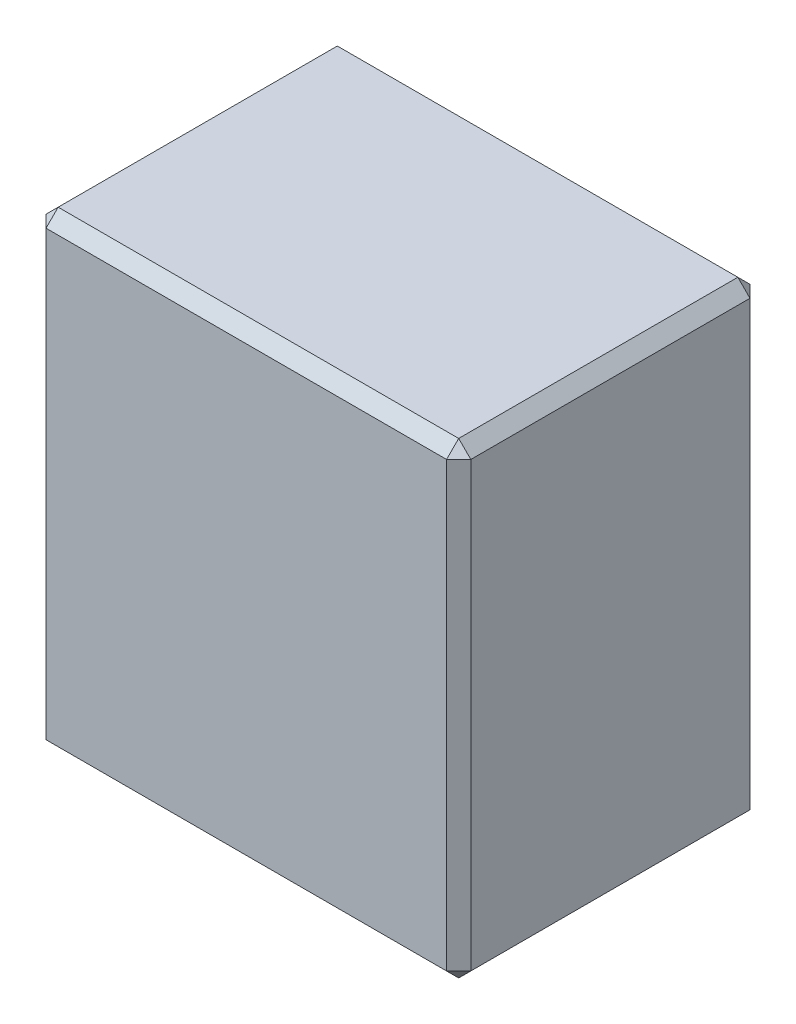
ISO-10303-21;
HEADER;
FILE_DESCRIPTION(('STEP AP214'),'2;1');
FILE_NAME('part.step','',(''),(''),'','','');
FILE_SCHEMA(('AUTOMOTIVE_DESIGN { 1 0 10303 214 1 1 1 1 }'));
ENDSEC;
DATA;
#1=APPLICATION_CONTEXT('core data for automotive mechanical design processes');
#2=APPLICATION_PROTOCOL_DEFINITION('international standard','automotive_design',2000,#1);
#3=PRODUCT_CONTEXT('',#1,'mechanical');
#4=PRODUCT('Part','Part','',(#3));
#5=PRODUCT_RELATED_PRODUCT_CATEGORY('part','',(#4));
#6=PRODUCT_DEFINITION_FORMATION('','',#4);
#7=PRODUCT_DEFINITION_CONTEXT('part definition',#1,'design');
#8=PRODUCT_DEFINITION('design','',#6,#7);
#9=PRODUCT_DEFINITION_SHAPE('','',#8);
#10=(LENGTH_UNIT() NAMED_UNIT(*) SI_UNIT(.MILLI.,.METRE.));
#11=(NAMED_UNIT(*) PLANE_ANGLE_UNIT() SI_UNIT($,.RADIAN.));
#12=(NAMED_UNIT(*) SI_UNIT($,.STERADIAN.) SOLID_ANGLE_UNIT());
#13=UNCERTAINTY_MEASURE_WITH_UNIT(LENGTH_MEASURE(1.E-05),#10,'distance_accuracy_value','');
#14=(GEOMETRIC_REPRESENTATION_CONTEXT(3) GLOBAL_UNCERTAINTY_ASSIGNED_CONTEXT((#13)) GLOBAL_UNIT_ASSIGNED_CONTEXT((#10,
#11,#12)) REPRESENTATION_CONTEXT('',''));
#15=CARTESIAN_POINT('',(0.,0.,0.));
#16=DIRECTION('',(0.,0.,1.));
#17=DIRECTION('',(1.,0.,0.));
#18=AXIS2_PLACEMENT_3D('',#15,#16,#17);
#19=CARTESIAN_POINT('',(0.,3.85,0.));
#20=DIRECTION('',(1.,0.,0.));
#21=DIRECTION('',(0.,0.,-1.));
#22=AXIS2_PLACEMENT_3D('',#19,#20,#21);
#23=PLANE('',#22);
#24=DIRECTION('',(0.,1.,0.));
#25=VECTOR('',#24,1.);
#26=CARTESIAN_POINT('',(0.,3.85,-0.100000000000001));
#27=LINE('',#26,#25);
#28=CARTESIAN_POINT('',(0.,0.1,-0.100000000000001));
#29=VERTEX_POINT('',#28);
#30=CARTESIAN_POINT('',(0.,3.75,-0.100000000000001));
#31=VERTEX_POINT('',#30);
#32=EDGE_CURVE('E179',#29,#31,#27,.T.);
#33=ORIENTED_EDGE('',*,*,#32,.T.);
#34=DIRECTION('',(0.,0.,-1.));
#35=VECTOR('',#34,1.);
#36=CARTESIAN_POINT('',(0.,3.75,0.));
#37=LINE('',#36,#35);
#38=CARTESIAN_POINT('',(0.,3.75,-2.4));
#39=VERTEX_POINT('',#38);
#40=EDGE_CURVE('E184',#31,#39,#37,.T.);
#41=ORIENTED_EDGE('',*,*,#40,.T.);
#42=DIRECTION('',(0.,-1.,0.));
#43=VECTOR('',#42,1.);
#44=CARTESIAN_POINT('',(0.,3.85,-2.4));
#45=LINE('',#44,#43);
#46=CARTESIAN_POINT('',(0.,0.1,-2.4));
#47=VERTEX_POINT('',#46);
#48=EDGE_CURVE('E181',#39,#47,#45,.T.);
#49=ORIENTED_EDGE('',*,*,#48,.T.);
#50=DIRECTION('',(0.,0.,1.));
#51=VECTOR('',#50,1.);
#52=CARTESIAN_POINT('',(0.,0.1,0.));
#53=LINE('',#52,#51);
#54=EDGE_CURVE('E177',#47,#29,#53,.T.);
#55=ORIENTED_EDGE('',*,*,#54,.T.);
#56=EDGE_LOOP('',(#33,#41,#49,#55));
#57=FACE_BOUND('',#56,.T.);
#58=ADVANCED_FACE('F33',(#57),#23,.F.);
#59=CARTESIAN_POINT('',(0.,3.85,0.));
#60=DIRECTION('',(0.,0.,-1.));
#61=DIRECTION('',(-1.,0.,0.));
#62=AXIS2_PLACEMENT_3D('',#59,#60,#61);
#63=PLANE('',#62);
#64=DIRECTION('',(-1.,0.,0.));
#65=VECTOR('',#64,1.);
#66=CARTESIAN_POINT('',(0.,3.75,0.));
#67=LINE('',#66,#65);
#68=CARTESIAN_POINT('',(3.4,3.75,0.));
#69=VERTEX_POINT('',#68);
#70=CARTESIAN_POINT('',(0.1,3.75,0.));
#71=VERTEX_POINT('',#70);
#72=EDGE_CURVE('E40',#69,#71,#67,.T.);
#73=ORIENTED_EDGE('',*,*,#72,.T.);
#74=DIRECTION('',(0.,-1.,0.));
#75=VECTOR('',#74,1.);
#76=CARTESIAN_POINT('',(0.1,3.85,0.));
#77=LINE('',#76,#75);
#78=CARTESIAN_POINT('',(0.1,0.1,0.));
#79=VERTEX_POINT('',#78);
#80=EDGE_CURVE('E11',#71,#79,#77,.T.);
#81=ORIENTED_EDGE('',*,*,#80,.T.);
#82=DIRECTION('',(1.,0.,0.));
#83=VECTOR('',#82,1.);
#84=CARTESIAN_POINT('',(3.5,0.1,0.));
#85=LINE('',#84,#83);
#86=CARTESIAN_POINT('',(3.4,0.1,0.));
#87=VERTEX_POINT('',#86);
#88=EDGE_CURVE('E53',#79,#87,#85,.T.);
#89=ORIENTED_EDGE('',*,*,#88,.T.);
#90=DIRECTION('',(0.,1.,0.));
#91=VECTOR('',#90,1.);
#92=CARTESIAN_POINT('',(3.4,3.85,0.));
#93=LINE('',#92,#91);
#94=EDGE_CURVE('E195',#87,#69,#93,.T.);
#95=ORIENTED_EDGE('',*,*,#94,.T.);
#96=EDGE_LOOP('',(#73,#81,#89,#95));
#97=FACE_BOUND('',#96,.T.);
#98=ADVANCED_FACE('F198',(#97),#63,.F.);
#99=CARTESIAN_POINT('',(3.5,3.85,0.));
#100=DIRECTION('',(-1.,0.,0.));
#101=DIRECTION('',(0.,0.,1.));
#102=AXIS2_PLACEMENT_3D('',#99,#100,#101);
#103=PLANE('',#102);
#104=DIRECTION('',(0.,0.,-1.));
#105=VECTOR('',#104,1.);
#106=CARTESIAN_POINT('',(3.5,0.100000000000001,-2.5));
#107=LINE('',#106,#105);
#108=CARTESIAN_POINT('',(3.5,0.100000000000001,-0.100000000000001));
#109=VERTEX_POINT('',#108);
#110=CARTESIAN_POINT('',(3.5,0.100000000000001,-2.4));
#111=VERTEX_POINT('',#110);
#112=EDGE_CURVE('E165',#109,#111,#107,.T.);
#113=ORIENTED_EDGE('',*,*,#112,.T.);
#114=DIRECTION('',(0.,1.,0.));
#115=VECTOR('',#114,1.);
#116=CARTESIAN_POINT('',(3.5,3.85,-2.4));
#117=LINE('',#116,#115);
#118=CARTESIAN_POINT('',(3.5,3.75,-2.4));
#119=VERTEX_POINT('',#118);
#120=EDGE_CURVE('E128',#111,#119,#117,.T.);
#121=ORIENTED_EDGE('',*,*,#120,.T.);
#122=DIRECTION('',(0.,0.,1.));
#123=VECTOR('',#122,1.);
#124=CARTESIAN_POINT('',(3.5,3.75,0.));
#125=LINE('',#124,#123);
#126=CARTESIAN_POINT('',(3.5,3.75,-0.100000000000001));
#127=VERTEX_POINT('',#126);
#128=EDGE_CURVE('E157',#119,#127,#125,.T.);
#129=ORIENTED_EDGE('',*,*,#128,.T.);
#130=DIRECTION('',(0.,-1.,0.));
#131=VECTOR('',#130,1.);
#132=CARTESIAN_POINT('',(3.5,3.85,-0.100000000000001));
#133=LINE('',#132,#131);
#134=EDGE_CURVE('E159',#127,#109,#133,.T.);
#135=ORIENTED_EDGE('',*,*,#134,.T.);
#136=EDGE_LOOP('',(#113,#121,#129,#135));
#137=FACE_BOUND('',#136,.T.);
#138=ADVANCED_FACE('F286',(#137),#103,.F.);
#139=CARTESIAN_POINT('',(0.,3.85,-2.5));
#140=DIRECTION('',(0.,0.,1.));
#141=DIRECTION('',(1.,0.,0.));
#142=AXIS2_PLACEMENT_3D('',#139,#140,#141);
#143=PLANE('',#142);
#144=DIRECTION('',(1.,0.,0.));
#145=VECTOR('',#144,1.);
#146=CARTESIAN_POINT('',(0.,3.75,-2.5));
#147=LINE('',#146,#145);
#148=CARTESIAN_POINT('',(0.100000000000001,3.75,-2.5));
#149=VERTEX_POINT('',#148);
#150=CARTESIAN_POINT('',(3.4,3.75,-2.5));
#151=VERTEX_POINT('',#150);
#152=EDGE_CURVE('E155',#149,#151,#147,.T.);
#153=ORIENTED_EDGE('',*,*,#152,.T.);
#154=DIRECTION('',(0.,-1.,0.));
#155=VECTOR('',#154,1.);
#156=CARTESIAN_POINT('',(3.4,3.85,-2.5));
#157=LINE('',#156,#155);
#158=CARTESIAN_POINT('',(3.4,0.1,-2.5));
#159=VERTEX_POINT('',#158);
#160=EDGE_CURVE('E126',#151,#159,#157,.T.);
#161=ORIENTED_EDGE('',*,*,#160,.T.);
#162=DIRECTION('',(-1.,0.,0.));
#163=VECTOR('',#162,1.);
#164=CARTESIAN_POINT('',(0.,0.1,-2.5));
#165=LINE('',#164,#163);
#166=CARTESIAN_POINT('',(0.100000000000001,0.1,-2.5));
#167=VERTEX_POINT('',#166);
#168=EDGE_CURVE('E144',#159,#167,#165,.T.);
#169=ORIENTED_EDGE('',*,*,#168,.T.);
#170=DIRECTION('',(0.,1.,0.));
#171=VECTOR('',#170,1.);
#172=CARTESIAN_POINT('',(0.100000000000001,3.85,-2.5));
#173=LINE('',#172,#171);
#174=EDGE_CURVE('E150',#167,#149,#173,.T.);
#175=ORIENTED_EDGE('',*,*,#174,.T.);
#176=EDGE_LOOP('',(#153,#161,#169,#175));
#177=FACE_BOUND('',#176,.T.);
#178=ADVANCED_FACE('F153',(#177),#143,.F.);
#179=CARTESIAN_POINT('',(0.,3.85,-2.5));
#180=DIRECTION('',(0.,-1.,0.));
#181=DIRECTION('',(0.,0.,-1.));
#182=AXIS2_PLACEMENT_3D('',#179,#180,#181);
#183=PLANE('',#182);
#184=DIRECTION('',(0.,0.,-1.));
#185=VECTOR('',#184,1.);
#186=CARTESIAN_POINT('',(3.4,3.85,-2.5));
#187=LINE('',#186,#185);
#188=CARTESIAN_POINT('',(3.4,3.85,-0.1));
#189=VERTEX_POINT('',#188);
#190=CARTESIAN_POINT('',(3.4,3.85,-2.4));
#191=VERTEX_POINT('',#190);
#192=EDGE_CURVE('E168',#189,#191,#187,.T.);
#193=ORIENTED_EDGE('',*,*,#192,.T.);
#194=DIRECTION('',(-1.,0.,0.));
#195=VECTOR('',#194,1.);
#196=CARTESIAN_POINT('',(0.,3.85,-2.4));
#197=LINE('',#196,#195);
#198=CARTESIAN_POINT('',(0.1,3.85,-2.4));
#199=VERTEX_POINT('',#198);
#200=EDGE_CURVE('E174',#191,#199,#197,.T.);
#201=ORIENTED_EDGE('',*,*,#200,.T.);
#202=DIRECTION('',(0.,0.,1.));
#203=VECTOR('',#202,1.);
#204=CARTESIAN_POINT('',(0.1,3.85,-2.5));
#205=LINE('',#204,#203);
#206=CARTESIAN_POINT('',(0.1,3.85,-0.1));
#207=VERTEX_POINT('',#206);
#208=EDGE_CURVE('E172',#199,#207,#205,.T.);
#209=ORIENTED_EDGE('',*,*,#208,.T.);
#210=DIRECTION('',(1.,0.,0.));
#211=VECTOR('',#210,1.);
#212=CARTESIAN_POINT('',(0.,3.85,-0.1));
#213=LINE('',#212,#211);
#214=EDGE_CURVE('E170',#207,#189,#213,.T.);
#215=ORIENTED_EDGE('',*,*,#214,.T.);
#216=EDGE_LOOP('',(#193,#201,#209,#215));
#217=FACE_BOUND('',#216,.T.);
#218=ADVANCED_FACE('F295',(#217),#183,.F.);
#219=CARTESIAN_POINT('',(0.,0.,-2.5));
#220=DIRECTION('',(0.,-1.,0.));
#221=DIRECTION('',(0.,0.,-1.));
#222=AXIS2_PLACEMENT_3D('',#219,#220,#221);
#223=PLANE('',#222);
#224=DIRECTION('',(0.,0.,-1.));
#225=VECTOR('',#224,1.);
#226=CARTESIAN_POINT('',(0.100000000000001,0.,-2.5));
#227=LINE('',#226,#225);
#228=CARTESIAN_POINT('',(0.100000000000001,0.,-0.100000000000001));
#229=VERTEX_POINT('',#228);
#230=CARTESIAN_POINT('',(0.100000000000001,0.,-2.4));
#231=VERTEX_POINT('',#230);
#232=EDGE_CURVE('E190',#229,#231,#227,.T.);
#233=ORIENTED_EDGE('',*,*,#232,.T.);
#234=DIRECTION('',(1.,0.,0.));
#235=VECTOR('',#234,1.);
#236=CARTESIAN_POINT('',(3.5,0.,-2.4));
#237=LINE('',#236,#235);
#238=CARTESIAN_POINT('',(3.4,0.,-2.4));
#239=VERTEX_POINT('',#238);
#240=EDGE_CURVE('E192',#231,#239,#237,.T.);
#241=ORIENTED_EDGE('',*,*,#240,.T.);
#242=DIRECTION('',(0.,0.,1.));
#243=VECTOR('',#242,1.);
#244=CARTESIAN_POINT('',(3.4,0.,0.));
#245=LINE('',#244,#243);
#246=CARTESIAN_POINT('',(3.4,0.,-0.100000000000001));
#247=VERTEX_POINT('',#246);
#248=EDGE_CURVE('E186',#239,#247,#245,.T.);
#249=ORIENTED_EDGE('',*,*,#248,.T.);
#250=DIRECTION('',(-1.,0.,0.));
#251=VECTOR('',#250,1.);
#252=CARTESIAN_POINT('',(0.,0.,-0.100000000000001));
#253=LINE('',#252,#251);
#254=EDGE_CURVE('E188',#247,#229,#253,.T.);
#255=ORIENTED_EDGE('',*,*,#254,.T.);
#256=EDGE_LOOP('',(#233,#241,#249,#255));
#257=FACE_BOUND('',#256,.T.);
#258=ADVANCED_FACE('F318',(#257),#223,.T.);
#259=CARTESIAN_POINT('',(0.1,3.85,0.));
#260=DIRECTION('',(0.707106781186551,0.,-0.707106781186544));
#261=DIRECTION('',(-0.707106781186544,0.,-0.707106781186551));
#262=AXIS2_PLACEMENT_3D('',#259,#260,#261);
#263=PLANE('',#262);
#264=DIRECTION('',(-0.707106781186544,0.,-0.707106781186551));
#265=VECTOR('',#264,1.);
#266=CARTESIAN_POINT('',(0.,3.75,-0.100000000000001));
#267=LINE('',#266,#265);
#268=EDGE_CURVE('E151',#31,#71,#267,.F.);
#269=ORIENTED_EDGE('',*,*,#268,.F.);
#270=ORIENTED_EDGE('',*,*,#32,.F.);
#271=DIRECTION('',(0.707106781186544,0.,0.707106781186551));
#272=VECTOR('',#271,1.);
#273=CARTESIAN_POINT('',(0.1,0.1,0.));
#274=LINE('',#273,#272);
#275=EDGE_CURVE('E252',#79,#29,#274,.F.);
#276=ORIENTED_EDGE('',*,*,#275,.F.);
#277=ORIENTED_EDGE('',*,*,#80,.F.);
#278=EDGE_LOOP('',(#269,#270,#276,#277));
#279=FACE_BOUND('',#278,.T.);
#280=ADVANCED_FACE('F307',(#279),#263,.F.);
#281=CARTESIAN_POINT('',(0.,3.75,-0.100000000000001));
#282=DIRECTION('',(-0.577350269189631,0.577350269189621,0.577350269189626));
#283=DIRECTION('',(0.707106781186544,0.,0.707106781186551));
#284=AXIS2_PLACEMENT_3D('',#281,#282,#283);
#285=PLANE('',#284);
#286=DIRECTION('',(0.707106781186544,0.707106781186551,0.));
#287=VECTOR('',#286,1.);
#288=CARTESIAN_POINT('',(0.,3.75,-0.100000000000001));
#289=LINE('',#288,#287);
#290=EDGE_CURVE('E246',#31,#207,#289,.T.);
#291=ORIENTED_EDGE('',*,*,#290,.F.);
#292=ORIENTED_EDGE('',*,*,#268,.T.);
#293=DIRECTION('',(0.,-0.707106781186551,0.707106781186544));
#294=VECTOR('',#293,1.);
#295=CARTESIAN_POINT('',(0.1,3.8,-0.0500000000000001));
#296=LINE('',#295,#294);
#297=EDGE_CURVE('E249',#207,#71,#296,.T.);
#298=ORIENTED_EDGE('',*,*,#297,.F.);
#299=EDGE_LOOP('',(#291,#292,#298));
#300=FACE_BOUND('',#299,.T.);
#301=ADVANCED_FACE('F302',(#300),#285,.T.);
#302=CARTESIAN_POINT('',(0.1,0.1,0.));
#303=DIRECTION('',(-0.577350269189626,-0.577350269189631,0.577350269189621));
#304=DIRECTION('',(0.70710678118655,-0.707106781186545,0.));
#305=AXIS2_PLACEMENT_3D('',#302,#303,#304);
#306=PLANE('',#305);
#307=DIRECTION('',(0.,0.707106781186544,0.707106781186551));
#308=VECTOR('',#307,1.);
#309=CARTESIAN_POINT('',(0.1,0.1,0.));
#310=LINE('',#309,#308);
#311=EDGE_CURVE('E241',#79,#229,#310,.F.);
#312=ORIENTED_EDGE('',*,*,#311,.F.);
#313=ORIENTED_EDGE('',*,*,#275,.T.);
#314=DIRECTION('',(0.70710678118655,-0.707106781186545,0.));
#315=VECTOR('',#314,1.);
#316=CARTESIAN_POINT('',(0.0500000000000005,0.0500000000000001,-0.100000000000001));
#317=LINE('',#316,#315);
#318=EDGE_CURVE('E243',#229,#29,#317,.F.);
#319=ORIENTED_EDGE('',*,*,#318,.F.);
#320=EDGE_LOOP('',(#312,#313,#319));
#321=FACE_BOUND('',#320,.T.);
#322=ADVANCED_FACE('F311',(#321),#306,.T.);
#323=CARTESIAN_POINT('',(0.,3.85,-0.1));
#324=DIRECTION('',(0.,-0.707106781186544,-0.707106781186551));
#325=DIRECTION('',(0.,0.707106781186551,-0.707106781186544));
#326=AXIS2_PLACEMENT_3D('',#323,#324,#325);
#327=PLANE('',#326);
#328=ORIENTED_EDGE('',*,*,#297,.T.);
#329=ORIENTED_EDGE('',*,*,#72,.F.);
#330=DIRECTION('',(0.,0.707106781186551,-0.707106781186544));
#331=VECTOR('',#330,1.);
#332=CARTESIAN_POINT('',(3.4,3.85,-0.1));
#333=LINE('',#332,#331);
#334=EDGE_CURVE('E238',#189,#69,#333,.F.);
#335=ORIENTED_EDGE('',*,*,#334,.F.);
#336=ORIENTED_EDGE('',*,*,#214,.F.);
#337=EDGE_LOOP('',(#328,#329,#335,#336));
#338=FACE_BOUND('',#337,.T.);
#339=ADVANCED_FACE('F298',(#338),#327,.F.);
#340=CARTESIAN_POINT('',(0.1,3.85,-2.5));
#341=DIRECTION('',(0.707106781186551,-0.707106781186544,0.));
#342=DIRECTION('',(0.707106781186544,0.707106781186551,0.));
#343=AXIS2_PLACEMENT_3D('',#340,#341,#342);
#344=PLANE('',#343);
#345=ORIENTED_EDGE('',*,*,#290,.T.);
#346=ORIENTED_EDGE('',*,*,#208,.F.);
#347=DIRECTION('',(-0.707106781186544,-0.707106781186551,0.));
#348=VECTOR('',#347,1.);
#349=CARTESIAN_POINT('',(0.1,3.85,-2.4));
#350=LINE('',#349,#348);
#351=EDGE_CURVE('E235',#39,#199,#350,.F.);
#352=ORIENTED_EDGE('',*,*,#351,.F.);
#353=ORIENTED_EDGE('',*,*,#40,.F.);
#354=EDGE_LOOP('',(#345,#346,#352,#353));
#355=FACE_BOUND('',#354,.T.);
#356=ADVANCED_FACE('F333',(#355),#344,.F.);
#357=CARTESIAN_POINT('',(0.,3.85,-2.4));
#358=DIRECTION('',(0.707106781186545,0.,0.70710678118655));
#359=DIRECTION('',(0.70710678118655,0.,-0.707106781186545));
#360=AXIS2_PLACEMENT_3D('',#357,#358,#359);
#361=PLANE('',#360);
#362=DIRECTION('',(-0.70710678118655,0.,0.707106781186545));
#363=VECTOR('',#362,1.);
#364=CARTESIAN_POINT('',(0.,0.1,-2.4));
#365=LINE('',#364,#363);
#366=EDGE_CURVE('E229',#47,#167,#365,.F.);
#367=ORIENTED_EDGE('',*,*,#366,.F.);
#368=ORIENTED_EDGE('',*,*,#48,.F.);
#369=DIRECTION('',(0.70710678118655,0.,-0.707106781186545));
#370=VECTOR('',#369,1.);
#371=CARTESIAN_POINT('',(0.0500000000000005,3.75,-2.45));
#372=LINE('',#371,#370);
#373=EDGE_CURVE('E232',#149,#39,#372,.F.);
#374=ORIENTED_EDGE('',*,*,#373,.F.);
#375=ORIENTED_EDGE('',*,*,#174,.F.);
#376=EDGE_LOOP('',(#367,#368,#374,#375));
#377=FACE_BOUND('',#376,.T.);
#378=ADVANCED_FACE('F261',(#377),#361,.F.);
#379=CARTESIAN_POINT('',(0.,0.1,0.));
#380=DIRECTION('',(-0.707106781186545,-0.70710678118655,0.));
#381=DIRECTION('',(0.70710678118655,-0.707106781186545,0.));
#382=AXIS2_PLACEMENT_3D('',#379,#380,#381);
#383=PLANE('',#382);
#384=ORIENTED_EDGE('',*,*,#318,.T.);
#385=ORIENTED_EDGE('',*,*,#54,.F.);
#386=DIRECTION('',(-0.70710678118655,0.707106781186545,0.));
#387=VECTOR('',#386,1.);
#388=CARTESIAN_POINT('',(0.,0.1,-2.4));
#389=LINE('',#388,#387);
#390=EDGE_CURVE('E216',#231,#47,#389,.T.);
#391=ORIENTED_EDGE('',*,*,#390,.F.);
#392=ORIENTED_EDGE('',*,*,#232,.F.);
#393=EDGE_LOOP('',(#384,#385,#391,#392));
#394=FACE_BOUND('',#393,.T.);
#395=ADVANCED_FACE('F315',(#394),#383,.T.);
#396=CARTESIAN_POINT('',(0.,0.1,0.));
#397=DIRECTION('',(0.,-0.707106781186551,0.707106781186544));
#398=DIRECTION('',(0.,-0.707106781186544,-0.707106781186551));
#399=AXIS2_PLACEMENT_3D('',#396,#397,#398);
#400=PLANE('',#399);
#401=ORIENTED_EDGE('',*,*,#311,.T.);
#402=ORIENTED_EDGE('',*,*,#254,.F.);
#403=DIRECTION('',(0.,-0.707106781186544,-0.707106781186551));
#404=VECTOR('',#403,1.);
#405=CARTESIAN_POINT('',(3.4,0.1,0.));
#406=LINE('',#405,#404);
#407=EDGE_CURVE('E212',#87,#247,#406,.T.);
#408=ORIENTED_EDGE('',*,*,#407,.F.);
#409=ORIENTED_EDGE('',*,*,#88,.F.);
#410=EDGE_LOOP('',(#401,#402,#408,#409));
#411=FACE_BOUND('',#410,.T.);
#412=ADVANCED_FACE('F213',(#411),#400,.T.);
#413=CARTESIAN_POINT('',(3.5,3.85,-0.100000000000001));
#414=DIRECTION('',(-0.707106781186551,0.,-0.707106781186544));
#415=DIRECTION('',(-0.707106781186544,0.,0.707106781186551));
#416=AXIS2_PLACEMENT_3D('',#413,#414,#415);
#417=PLANE('',#416);
#418=DIRECTION('',(-0.707106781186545,0.,0.707106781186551));
#419=VECTOR('',#418,1.);
#420=CARTESIAN_POINT('',(3.45,3.75,-0.0500000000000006));
#421=LINE('',#420,#419);
#422=EDGE_CURVE('E208',#69,#127,#421,.F.);
#423=ORIENTED_EDGE('',*,*,#422,.F.);
#424=ORIENTED_EDGE('',*,*,#94,.F.);
#425=DIRECTION('',(0.707106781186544,0.,-0.707106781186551));
#426=VECTOR('',#425,1.);
#427=CARTESIAN_POINT('',(3.4,0.1,0.));
#428=LINE('',#427,#426);
#429=EDGE_CURVE('E205',#109,#87,#428,.F.);
#430=ORIENTED_EDGE('',*,*,#429,.F.);
#431=ORIENTED_EDGE('',*,*,#134,.F.);
#432=EDGE_LOOP('',(#423,#424,#430,#431));
#433=FACE_BOUND('',#432,.T.);
#434=ADVANCED_FACE('F202',(#433),#417,.F.);
#435=CARTESIAN_POINT('',(3.4,3.85,-0.1));
#436=DIRECTION('',(0.577350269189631,0.577350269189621,0.577350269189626));
#437=DIRECTION('',(0.707106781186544,0.,-0.707106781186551));
#438=AXIS2_PLACEMENT_3D('',#435,#436,#437);
#439=PLANE('',#438);
#440=ORIENTED_EDGE('',*,*,#334,.T.);
#441=ORIENTED_EDGE('',*,*,#422,.T.);
#442=DIRECTION('',(0.707106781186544,-0.707106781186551,0.));
#443=VECTOR('',#442,1.);
#444=CARTESIAN_POINT('',(3.4,3.85,-0.1));
#445=LINE('',#444,#443);
#446=EDGE_CURVE('E221',#189,#127,#445,.T.);
#447=ORIENTED_EDGE('',*,*,#446,.F.);
#448=EDGE_LOOP('',(#440,#441,#447));
#449=FACE_BOUND('',#448,.T.);
#450=ADVANCED_FACE('F289',(#449),#439,.T.);
#451=CARTESIAN_POINT('',(0.1,3.85,-2.4));
#452=DIRECTION('',(-0.577350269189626,0.577350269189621,-0.577350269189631));
#453=DIRECTION('',(-0.70710678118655,0.,0.707106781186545));
#454=AXIS2_PLACEMENT_3D('',#451,#452,#453);
#455=PLANE('',#454);
#456=ORIENTED_EDGE('',*,*,#373,.T.);
#457=ORIENTED_EDGE('',*,*,#351,.T.);
#458=DIRECTION('',(0.,0.707106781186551,0.707106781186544));
#459=VECTOR('',#458,1.);
#460=CARTESIAN_POINT('',(0.1,3.85,-2.4));
#461=LINE('',#460,#459);
#462=EDGE_CURVE('E224',#149,#199,#461,.T.);
#463=ORIENTED_EDGE('',*,*,#462,.F.);
#464=EDGE_LOOP('',(#456,#457,#463));
#465=FACE_BOUND('',#464,.T.);
#466=ADVANCED_FACE('F264',(#465),#455,.T.);
#467=CARTESIAN_POINT('',(0.,0.1,-2.4));
#468=DIRECTION('',(-0.577350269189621,-0.577350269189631,-0.577350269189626));
#469=DIRECTION('',(0.,0.707106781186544,-0.70710678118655));
#470=AXIS2_PLACEMENT_3D('',#467,#468,#469);
#471=PLANE('',#470);
#472=ORIENTED_EDGE('',*,*,#390,.T.);
#473=ORIENTED_EDGE('',*,*,#366,.T.);
#474=DIRECTION('',(0.,-0.707106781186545,0.707106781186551));
#475=VECTOR('',#474,1.);
#476=CARTESIAN_POINT('',(0.100000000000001,0.0500000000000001,-2.45));
#477=LINE('',#476,#475);
#478=EDGE_CURVE('E147',#231,#167,#477,.F.);
#479=ORIENTED_EDGE('',*,*,#478,.F.);
#480=EDGE_LOOP('',(#472,#473,#479));
#481=FACE_BOUND('',#480,.T.);
#482=ADVANCED_FACE('F409',(#481),#471,.T.);
#483=CARTESIAN_POINT('',(3.4,0.1,0.));
#484=DIRECTION('',(0.577350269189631,-0.577350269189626,0.577350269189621));
#485=DIRECTION('',(0.707106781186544,0.707106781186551,0.));
#486=AXIS2_PLACEMENT_3D('',#483,#484,#485);
#487=PLANE('',#486);
#488=ORIENTED_EDGE('',*,*,#429,.T.);
#489=ORIENTED_EDGE('',*,*,#407,.T.);
#490=DIRECTION('',(0.707106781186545,0.707106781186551,0.));
#491=VECTOR('',#490,1.);
#492=CARTESIAN_POINT('',(3.45,0.0500000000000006,-0.100000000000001));
#493=LINE('',#492,#491);
#494=EDGE_CURVE('E219',#109,#247,#493,.F.);
#495=ORIENTED_EDGE('',*,*,#494,.F.);
#496=EDGE_LOOP('',(#488,#489,#495));
#497=FACE_BOUND('',#496,.T.);
#498=ADVANCED_FACE('F218',(#497),#487,.T.);
#499=CARTESIAN_POINT('',(3.4,3.85,-2.5));
#500=DIRECTION('',(-0.707106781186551,-0.707106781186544,0.));
#501=DIRECTION('',(0.707106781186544,-0.707106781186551,0.));
#502=AXIS2_PLACEMENT_3D('',#499,#500,#501);
#503=PLANE('',#502);
#504=ORIENTED_EDGE('',*,*,#446,.T.);
#505=ORIENTED_EDGE('',*,*,#128,.F.);
#506=DIRECTION('',(-0.707106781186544,0.707106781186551,0.));
#507=VECTOR('',#506,1.);
#508=CARTESIAN_POINT('',(3.5,3.75,-2.4));
#509=LINE('',#508,#507);
#510=EDGE_CURVE('E274',#191,#119,#509,.F.);
#511=ORIENTED_EDGE('',*,*,#510,.F.);
#512=ORIENTED_EDGE('',*,*,#192,.F.);
#513=EDGE_LOOP('',(#504,#505,#511,#512));
#514=FACE_BOUND('',#513,.T.);
#515=ADVANCED_FACE('F293',(#514),#503,.F.);
#516=CARTESIAN_POINT('',(0.,3.85,-2.4));
#517=DIRECTION('',(0.,-0.707106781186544,0.707106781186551));
#518=DIRECTION('',(0.,-0.707106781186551,-0.707106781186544));
#519=AXIS2_PLACEMENT_3D('',#516,#517,#518);
#520=PLANE('',#519);
#521=ORIENTED_EDGE('',*,*,#462,.T.);
#522=ORIENTED_EDGE('',*,*,#200,.F.);
#523=DIRECTION('',(0.,-0.707106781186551,-0.707106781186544));
#524=VECTOR('',#523,1.);
#525=CARTESIAN_POINT('',(3.4,3.8,-2.45));
#526=LINE('',#525,#524);
#527=EDGE_CURVE('E141',#151,#191,#526,.F.);
#528=ORIENTED_EDGE('',*,*,#527,.F.);
#529=ORIENTED_EDGE('',*,*,#152,.F.);
#530=EDGE_LOOP('',(#521,#522,#528,#529));
#531=FACE_BOUND('',#530,.T.);
#532=ADVANCED_FACE('F268',(#531),#520,.F.);
#533=CARTESIAN_POINT('',(0.,0.1,-2.5));
#534=DIRECTION('',(0.,-0.707106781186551,-0.707106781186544));
#535=DIRECTION('',(0.,0.707106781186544,-0.707106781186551));
#536=AXIS2_PLACEMENT_3D('',#533,#534,#535);
#537=PLANE('',#536);
#538=ORIENTED_EDGE('',*,*,#478,.T.);
#539=ORIENTED_EDGE('',*,*,#168,.F.);
#540=DIRECTION('',(0.,0.707106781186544,-0.707106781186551));
#541=VECTOR('',#540,1.);
#542=CARTESIAN_POINT('',(3.4,0.1,-2.5));
#543=LINE('',#542,#541);
#544=EDGE_CURVE('E133',#239,#159,#543,.T.);
#545=ORIENTED_EDGE('',*,*,#544,.F.);
#546=ORIENTED_EDGE('',*,*,#240,.F.);
#547=EDGE_LOOP('',(#538,#539,#545,#546));
#548=FACE_BOUND('',#547,.T.);
#549=ADVANCED_FACE('F145',(#548),#537,.T.);
#550=CARTESIAN_POINT('',(3.5,0.100000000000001,0.));
#551=DIRECTION('',(0.707106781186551,-0.707106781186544,0.));
#552=DIRECTION('',(0.707106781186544,0.707106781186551,0.));
#553=AXIS2_PLACEMENT_3D('',#550,#551,#552);
#554=PLANE('',#553);
#555=ORIENTED_EDGE('',*,*,#494,.T.);
#556=ORIENTED_EDGE('',*,*,#248,.F.);
#557=DIRECTION('',(-0.707106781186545,-0.707106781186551,0.));
#558=VECTOR('',#557,1.);
#559=CARTESIAN_POINT('',(3.45,0.0500000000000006,-2.4));
#560=LINE('',#559,#558);
#561=EDGE_CURVE('E137',#111,#239,#560,.T.);
#562=ORIENTED_EDGE('',*,*,#561,.F.);
#563=ORIENTED_EDGE('',*,*,#112,.F.);
#564=EDGE_LOOP('',(#555,#556,#562,#563));
#565=FACE_BOUND('',#564,.T.);
#566=ADVANCED_FACE('F284',(#565),#554,.T.);
#567=CARTESIAN_POINT('',(3.5,3.75,-2.4));
#568=DIRECTION('',(0.577350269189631,0.577350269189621,-0.577350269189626));
#569=DIRECTION('',(-0.707106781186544,0.,-0.707106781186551));
#570=AXIS2_PLACEMENT_3D('',#567,#568,#569);
#571=PLANE('',#570);
#572=ORIENTED_EDGE('',*,*,#527,.T.);
#573=ORIENTED_EDGE('',*,*,#510,.T.);
#574=DIRECTION('',(0.707106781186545,0.,0.707106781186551));
#575=VECTOR('',#574,1.);
#576=CARTESIAN_POINT('',(3.5,3.75,-2.4));
#577=LINE('',#576,#575);
#578=EDGE_CURVE('E130',#151,#119,#577,.T.);
#579=ORIENTED_EDGE('',*,*,#578,.F.);
#580=EDGE_LOOP('',(#572,#573,#579));
#581=FACE_BOUND('',#580,.T.);
#582=ADVANCED_FACE('F276',(#581),#571,.T.);
#583=CARTESIAN_POINT('',(3.4,0.1,-2.5));
#584=DIRECTION('',(0.577350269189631,-0.577350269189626,-0.577350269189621));
#585=DIRECTION('',(0.707106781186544,0.707106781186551,0.));
#586=AXIS2_PLACEMENT_3D('',#583,#584,#585);
#587=PLANE('',#586);
#588=ORIENTED_EDGE('',*,*,#561,.T.);
#589=ORIENTED_EDGE('',*,*,#544,.T.);
#590=DIRECTION('',(-0.707106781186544,0.,-0.707106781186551));
#591=VECTOR('',#590,1.);
#592=CARTESIAN_POINT('',(3.4,0.1,-2.5));
#593=LINE('',#592,#591);
#594=EDGE_CURVE('E122',#111,#159,#593,.T.);
#595=ORIENTED_EDGE('',*,*,#594,.F.);
#596=EDGE_LOOP('',(#588,#589,#595));
#597=FACE_BOUND('',#596,.T.);
#598=ADVANCED_FACE('F135',(#597),#587,.T.);
#599=CARTESIAN_POINT('',(3.4,3.85,-2.5));
#600=DIRECTION('',(-0.707106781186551,0.,0.707106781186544));
#601=DIRECTION('',(0.707106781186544,0.,0.707106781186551));
#602=AXIS2_PLACEMENT_3D('',#599,#600,#601);
#603=PLANE('',#602);
#604=ORIENTED_EDGE('',*,*,#578,.T.);
#605=ORIENTED_EDGE('',*,*,#120,.F.);
#606=ORIENTED_EDGE('',*,*,#594,.T.);
#607=ORIENTED_EDGE('',*,*,#160,.F.);
#608=EDGE_LOOP('',(#604,#605,#606,#607));
#609=FACE_BOUND('',#608,.T.);
#610=ADVANCED_FACE('F124',(#609),#603,.F.);
#611=CLOSED_SHELL('',(#58,#98,#138,#178,#218,#258,#280,#301,#322,#339,#356,#378,#395,#412,#434,
#450,#466,#482,#498,#515,#532,#549,#566,#582,#598,#610));
#612=MANIFOLD_SOLID_BREP('B2',#611);
#613=ADVANCED_BREP_SHAPE_REPRESENTATION('',(#18,#612),#14);
#614=SHAPE_DEFINITION_REPRESENTATION(#9,#613);
ENDSEC;
END-ISO-10303-21;
